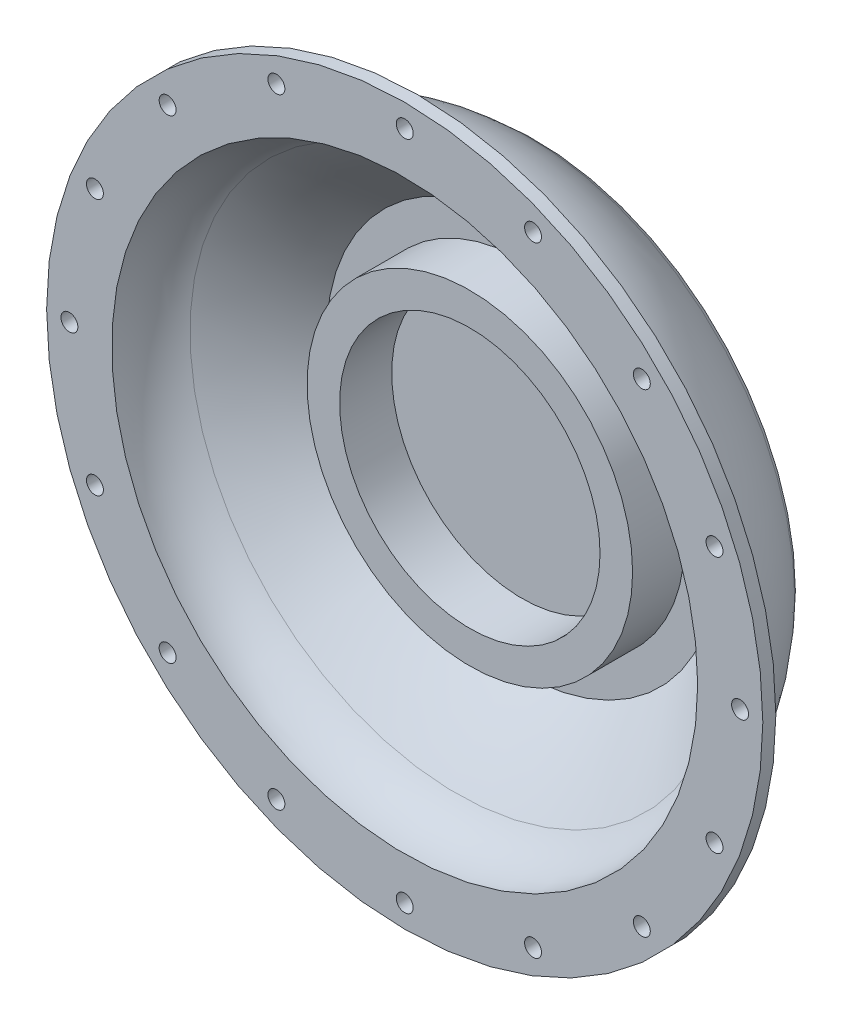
from build123d import *

# Parameters (mm, degrees)
TALADRO_DE_MARGEN_PARA_M21_D = 2.6
MATRIZC1_COUNT               = 16


with BuildPart() as part:
    # Croquis1 → Revoluci_n1 (revolve)
    with BuildSketch(Plane(origin=(0, 0, 0), x_dir=(0, 0, -1), z_dir=(1, 0, 0)), mode=Mode.PRIVATE) as revoluci_n1_sk:
        with BuildLine():
            Line((0, 55), (0, 45))
            ThreePointArc((0, 45), (4.47660101, 43.942037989), (8.005987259, 40.992008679))
            ThreePointArc((8.005987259, 40.992008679), (12.740700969, 35.257525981), (18, 30))
            Line((18, 30), (18, 25))
            Line((18, 25), (10, 25))
            Line((10, 25), (10, 20))
            Line((10, 20), (18, 20))
            Line((18, 20), (18, 0))
            Line((18, 0), (20, 0))
            Line((20, 0), (20, 40))
            ThreePointArc((20, 40), (19.553608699, 40.383768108), (19.118705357, 40.780507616))
            ThreePointArc((19.118705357, 40.780507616), (11.206320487, 45.80415685), (2, 47.561014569))
            Line((2, 47.561014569), (2, 55))
            Line((2, 55), (0, 55))
        make_face()
    revolve(revoluci_n1_sk.sketch.rotate(Axis((0, 0, 0), (0, 0, -1)), 90), axis=Axis((0, 0, 0), (0, 0, -1)))

    # Taladro de margen para M21 (through all)
    with Locations(Plane(origin=(0, 0, -2), x_dir=(-1, 0, 0), z_dir=(0, 0, -1))):
        with Locations((-51.5, 0)):
            taladro_de_margen_para_m21 = Hole(TALADRO_DE_MARGEN_PARA_M21_D / 2)

    # MatrizC1: Taladro de margen para M21 ×16 about axis
    matrizc1_axis = Axis((0, 0, 0), (0, 0, 1))
    for i in range(1, MATRIZC1_COUNT):
        add(taladro_de_margen_para_m21.rotate(matrizc1_axis, i * 360 / MATRIZC1_COUNT), mode=Mode.SUBTRACT)


solid = part.part
